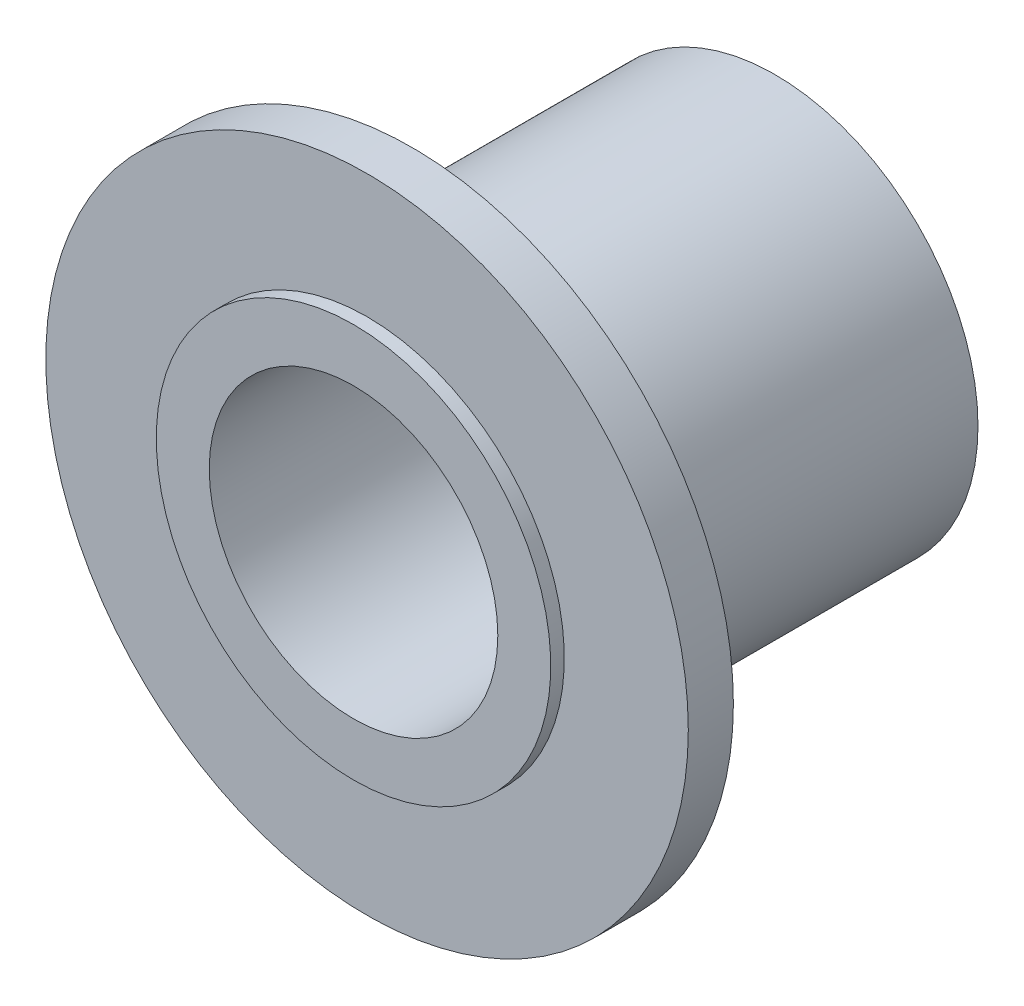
ISO-10303-21;
HEADER;
FILE_DESCRIPTION(('STEP AP214'),'2;1');
FILE_NAME('part.step','',(''),(''),'','','');
FILE_SCHEMA(('AUTOMOTIVE_DESIGN { 1 0 10303 214 1 1 1 1 }'));
ENDSEC;
DATA;
#1=APPLICATION_CONTEXT('core data for automotive mechanical design processes');
#2=APPLICATION_PROTOCOL_DEFINITION('international standard','automotive_design',2000,#1);
#3=PRODUCT_CONTEXT('',#1,'mechanical');
#4=PRODUCT('Part','Part','',(#3));
#5=PRODUCT_RELATED_PRODUCT_CATEGORY('part','',(#4));
#6=PRODUCT_DEFINITION_FORMATION('','',#4);
#7=PRODUCT_DEFINITION_CONTEXT('part definition',#1,'design');
#8=PRODUCT_DEFINITION('design','',#6,#7);
#9=PRODUCT_DEFINITION_SHAPE('','',#8);
#10=(LENGTH_UNIT() NAMED_UNIT(*) SI_UNIT(.MILLI.,.METRE.));
#11=(NAMED_UNIT(*) PLANE_ANGLE_UNIT() SI_UNIT($,.RADIAN.));
#12=(NAMED_UNIT(*) SI_UNIT($,.STERADIAN.) SOLID_ANGLE_UNIT());
#13=UNCERTAINTY_MEASURE_WITH_UNIT(LENGTH_MEASURE(1.E-05),#10,'distance_accuracy_value','');
#14=(GEOMETRIC_REPRESENTATION_CONTEXT(3) GLOBAL_UNCERTAINTY_ASSIGNED_CONTEXT((#13)) GLOBAL_UNIT_ASSIGNED_CONTEXT((#10,
#11,#12)) REPRESENTATION_CONTEXT('',''));
#15=CARTESIAN_POINT('',(0.,0.,0.));
#16=DIRECTION('',(0.,0.,1.));
#17=DIRECTION('',(1.,0.,0.));
#18=AXIS2_PLACEMENT_3D('',#15,#16,#17);
#19=CARTESIAN_POINT('',(88.5,-88.4999999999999,187.));
#20=DIRECTION('',(0.,0.,1.));
#21=DIRECTION('',(0.,1.,0.));
#22=AXIS2_PLACEMENT_3D('',#19,#20,#21);
#23=PLANE('',#22);
#24=CARTESIAN_POINT('',(0.,1.45716771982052E-13,187.));
#25=DIRECTION('',(0.,0.,-1.));
#26=DIRECTION('',(-1.,0.,0.));
#27=AXIS2_PLACEMENT_3D('',#24,#25,#26);
#28=CIRCLE('',#27,64.);
#29=CARTESIAN_POINT('',(0.,64.0000000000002,187.));
#30=VERTEX_POINT('',#29);
#31=EDGE_CURVE('E9',#30,#30,#28,.T.);
#32=ORIENTED_EDGE('',*,*,#31,.T.);
#33=EDGE_LOOP('',(#32));
#34=FACE_BOUND('',#33,.T.);
#35=CARTESIAN_POINT('',(0.,1.6306400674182E-13,187.));
#36=DIRECTION('',(0.,0.,1.));
#37=DIRECTION('',(1.,0.,0.));
#38=AXIS2_PLACEMENT_3D('',#35,#36,#37);
#39=CIRCLE('',#38,87.5);
#40=CARTESIAN_POINT('',(0.,87.5000000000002,187.));
#41=VERTEX_POINT('',#40);
#42=EDGE_CURVE('E24',#41,#41,#39,.T.);
#43=ORIENTED_EDGE('',*,*,#42,.T.);
#44=EDGE_LOOP('',(#43));
#45=FACE_BOUND('',#44,.T.);
#46=ADVANCED_FACE('F14',(#34,#45),#23,.T.);
#47=CARTESIAN_POINT('',(0.,1.6306400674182E-13,187.));
#48=DIRECTION('',(0.,0.,-1.));
#49=DIRECTION('',(-1.,0.,0.));
#50=AXIS2_PLACEMENT_3D('',#47,#48,#49);
#51=CYLINDRICAL_SURFACE('',#50,87.5);
#52=ORIENTED_EDGE('',*,*,#42,.F.);
#53=DIRECTION('',(0.,0.,1.));
#54=VECTOR('',#53,1.);
#55=CARTESIAN_POINT('',(0.,87.5000000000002,184.));
#56=LINE('',#55,#54);
#57=CARTESIAN_POINT('',(0.,87.5000000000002,181.));
#58=VERTEX_POINT('',#57);
#59=EDGE_CURVE('E62',#58,#41,#56,.T.);
#60=ORIENTED_EDGE('',*,*,#59,.F.);
#61=CARTESIAN_POINT('',(0.,1.6306400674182E-13,181.));
#62=DIRECTION('',(0.,0.,1.));
#63=DIRECTION('',(1.,0.,0.));
#64=AXIS2_PLACEMENT_3D('',#61,#62,#63);
#65=CIRCLE('',#64,87.5);
#66=EDGE_CURVE('E65',#58,#58,#65,.T.);
#67=ORIENTED_EDGE('',*,*,#66,.T.);
#68=ORIENTED_EDGE('',*,*,#59,.T.);
#69=EDGE_LOOP('',(#52,#60,#67,#68));
#70=FACE_BOUND('',#69,.T.);
#71=ADVANCED_FACE('F83',(#70),#51,.T.);
#72=CARTESIAN_POINT('',(-149.624988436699,-149.624988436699,181.));
#73=DIRECTION('',(0.,0.,1.));
#74=DIRECTION('',(1.,0.,0.));
#75=AXIS2_PLACEMENT_3D('',#72,#73,#74);
#76=PLANE('',#75);
#77=ORIENTED_EDGE('',*,*,#66,.F.);
#78=EDGE_LOOP('',(#77));
#79=FACE_BOUND('',#78,.T.);
#80=CARTESIAN_POINT('',(0.,2.54171053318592E-13,181.));
#81=DIRECTION('',(0.,0.,-1.));
#82=DIRECTION('',(0.,1.,0.));
#83=AXIS2_PLACEMENT_3D('',#80,#81,#82);
#84=CIRCLE('',#83,142.5);
#85=CARTESIAN_POINT('',(142.5,0.,181.));
#86=VERTEX_POINT('',#85);
#87=EDGE_CURVE('E57',#86,#86,#84,.T.);
#88=ORIENTED_EDGE('',*,*,#87,.F.);
#89=EDGE_LOOP('',(#88));
#90=FACE_BOUND('',#89,.T.);
#91=ADVANCED_FACE('F91',(#79,#90),#76,.T.);
#92=CARTESIAN_POINT('',(0.,0.,160.));
#93=DIRECTION('',(0.,0.,1.));
#94=DIRECTION('',(1.,0.,0.));
#95=AXIS2_PLACEMENT_3D('',#92,#93,#94);
#96=CYLINDRICAL_SURFACE('',#95,142.5);
#97=CARTESIAN_POINT('',(0.,0.,161.));
#98=DIRECTION('',(0.,0.,1.));
#99=DIRECTION('',(0.,-1.,0.));
#100=AXIS2_PLACEMENT_3D('',#97,#98,#99);
#101=CIRCLE('',#100,142.5);
#102=CARTESIAN_POINT('',(142.5,0.,161.));
#103=VERTEX_POINT('',#102);
#104=EDGE_CURVE('E56',#103,#103,#101,.T.);
#105=ORIENTED_EDGE('',*,*,#104,.T.);
#106=DIRECTION('',(0.,0.,-1.));
#107=VECTOR('',#106,1.);
#108=CARTESIAN_POINT('',(142.5,0.,171.));
#109=LINE('',#108,#107);
#110=EDGE_CURVE('E52',#86,#103,#109,.T.);
#111=ORIENTED_EDGE('',*,*,#110,.F.);
#112=ORIENTED_EDGE('',*,*,#87,.T.);
#113=ORIENTED_EDGE('',*,*,#110,.T.);
#114=EDGE_LOOP('',(#105,#111,#112,#113));
#115=FACE_BOUND('',#114,.T.);
#116=ADVANCED_FACE('F55',(#115),#96,.T.);
#117=CARTESIAN_POINT('',(-149.624988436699,-149.624988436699,161.));
#118=DIRECTION('',(0.,0.,-1.));
#119=DIRECTION('',(0.,1.,0.));
#120=AXIS2_PLACEMENT_3D('',#117,#118,#119);
#121=PLANE('',#120);
#122=CARTESIAN_POINT('',(0.,0.,161.));
#123=DIRECTION('',(0.,0.,-1.));
#124=DIRECTION('',(0.,1.,0.));
#125=AXIS2_PLACEMENT_3D('',#122,#123,#124);
#126=CIRCLE('',#125,90.);
#127=CARTESIAN_POINT('',(90.,0.,161.));
#128=VERTEX_POINT('',#127);
#129=EDGE_CURVE('E58',#128,#128,#126,.T.);
#130=ORIENTED_EDGE('',*,*,#129,.F.);
#131=EDGE_LOOP('',(#130));
#132=FACE_BOUND('',#131,.T.);
#133=ORIENTED_EDGE('',*,*,#104,.F.);
#134=EDGE_LOOP('',(#133));
#135=FACE_BOUND('',#134,.T.);
#136=ADVANCED_FACE('F61',(#132,#135),#121,.T.);
#137=CARTESIAN_POINT('',(0.,0.,0.));
#138=DIRECTION('',(0.,0.,1.));
#139=DIRECTION('',(1.,0.,0.));
#140=AXIS2_PLACEMENT_3D('',#137,#138,#139);
#141=CYLINDRICAL_SURFACE('',#140,90.);
#142=CARTESIAN_POINT('',(0.,0.,0.));
#143=DIRECTION('',(0.,0.,-1.));
#144=DIRECTION('',(-1.,0.,0.));
#145=AXIS2_PLACEMENT_3D('',#142,#143,#144);
#146=CIRCLE('',#145,90.);
#147=CARTESIAN_POINT('',(90.,0.,0.));
#148=VERTEX_POINT('',#147);
#149=EDGE_CURVE('E77',#148,#148,#146,.T.);
#150=ORIENTED_EDGE('',*,*,#149,.F.);
#151=DIRECTION('',(0.,0.,-1.));
#152=VECTOR('',#151,1.);
#153=CARTESIAN_POINT('',(90.,0.,80.5));
#154=LINE('',#153,#152);
#155=EDGE_CURVE('E72',#128,#148,#154,.T.);
#156=ORIENTED_EDGE('',*,*,#155,.F.);
#157=ORIENTED_EDGE('',*,*,#129,.T.);
#158=ORIENTED_EDGE('',*,*,#155,.T.);
#159=EDGE_LOOP('',(#150,#156,#157,#158));
#160=FACE_BOUND('',#159,.T.);
#161=ADVANCED_FACE('F105',(#160),#141,.T.);
#162=CARTESIAN_POINT('',(-91.,91.,0.));
#163=DIRECTION('',(0.,0.,-1.));
#164=DIRECTION('',(1.,0.,0.));
#165=AXIS2_PLACEMENT_3D('',#162,#163,#164);
#166=PLANE('',#165);
#167=CARTESIAN_POINT('',(0.,0.,0.));
#168=DIRECTION('',(0.,0.,1.));
#169=DIRECTION('',(1.,0.,0.));
#170=AXIS2_PLACEMENT_3D('',#167,#168,#169);
#171=CIRCLE('',#170,64.0000000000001);
#172=CARTESIAN_POINT('',(0.,64.0000000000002,0.));
#173=VERTEX_POINT('',#172);
#174=EDGE_CURVE('E75',#173,#173,#171,.T.);
#175=ORIENTED_EDGE('',*,*,#174,.T.);
#176=EDGE_LOOP('',(#175));
#177=FACE_BOUND('',#176,.T.);
#178=ORIENTED_EDGE('',*,*,#149,.T.);
#179=EDGE_LOOP('',(#178));
#180=FACE_BOUND('',#179,.T.);
#181=ADVANCED_FACE('F108',(#177,#180),#166,.T.);
#182=CARTESIAN_POINT('',(0.,1.45716771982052E-13,187.));
#183=DIRECTION('',(0.,0.,-1.));
#184=DIRECTION('',(-1.,0.,0.));
#185=AXIS2_PLACEMENT_3D('',#182,#183,#184);
#186=CYLINDRICAL_SURFACE('',#185,64.);
#187=ORIENTED_EDGE('',*,*,#174,.F.);
#188=DIRECTION('',(0.,0.,-1.));
#189=VECTOR('',#188,1.);
#190=CARTESIAN_POINT('',(0.,64.0000000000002,93.5));
#191=LINE('',#190,#189);
#192=EDGE_CURVE('E18',#30,#173,#191,.T.);
#193=ORIENTED_EDGE('',*,*,#192,.F.);
#194=ORIENTED_EDGE('',*,*,#31,.F.);
#195=ORIENTED_EDGE('',*,*,#192,.T.);
#196=EDGE_LOOP('',(#187,#193,#194,#195));
#197=FACE_BOUND('',#196,.T.);
#198=ADVANCED_FACE('F16',(#197),#186,.F.);
#199=CLOSED_SHELL('',(#46,#71,#91,#116,#136,#161,#181,#198));
#200=MANIFOLD_SOLID_BREP('B1',#199);
#201=ADVANCED_BREP_SHAPE_REPRESENTATION('',(#18,#200),#14);
#202=SHAPE_DEFINITION_REPRESENTATION(#9,#201);
ENDSEC;
END-ISO-10303-21;
